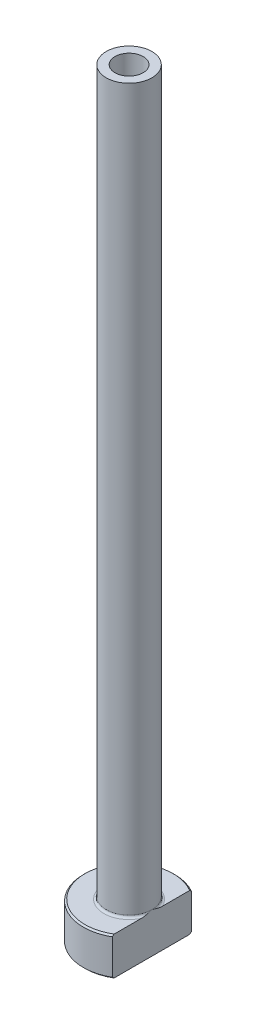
from build123d import *

# Parameters (mm, degrees)
FILLET1_R          = 0.3
CHAMFER1_SIZE      = 0.2
CUT_EXTRUDE1_DEPTH = 101.359354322
CHAMFER2_SIZE      = 0.5


with BuildPart() as part:
    # Sketch1 → Revolve1 (revolve)
    with BuildSketch(Plane.XY, mode=Mode.PRIVATE) as revolve1_sk:
        Polygon((-1.85, 100), (-3, 100), (-3, 5), (-6, 5), (-6, 0), (-2.1, 0), (-2.1, 43), (-1.85, 55), align=None)
    revolve(revolve1_sk.sketch.rotate(Axis((0, 92.187680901, 0), (0, -1, 0)), 270), axis=Axis((0, 92.187680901, 0), (0, -1, 0)))

    # Fillet1
    fillet1_edges = [part.edges().sort_by_distance(p)[0] for p in [
        (0, 5, -3),
    ]]
    fillet(fillet1_edges, radius=FILLET1_R)

    # Chamfer1
    chamfer1_edges = [part.edges().sort_by_distance(p)[0] for p in [
        (0, 0, -6),
        (0, 5, -6),
    ]]
    chamfer(chamfer1_edges, length=CHAMFER1_SIZE)

    # Sketch2 → Cut-Extrude1 (cut, through all)
    with BuildSketch(Plane.XZ):
        with BuildLine():
            Line((3, 5.196152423), (3, -5.196152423))
            ThreePointArc((3, -5.196152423), (6, 0), (3, 5.196152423))
        make_face()
    extrude(amount=-CUT_EXTRUDE1_DEPTH, mode=Mode.SUBTRACT)

    # Chamfer2
    chamfer2_edges = [part.edges().sort_by_distance(p)[0] for p in [
        (0, 0, -2.1),
    ]]
    chamfer(chamfer2_edges, length=CHAMFER2_SIZE)


solid = part.part
